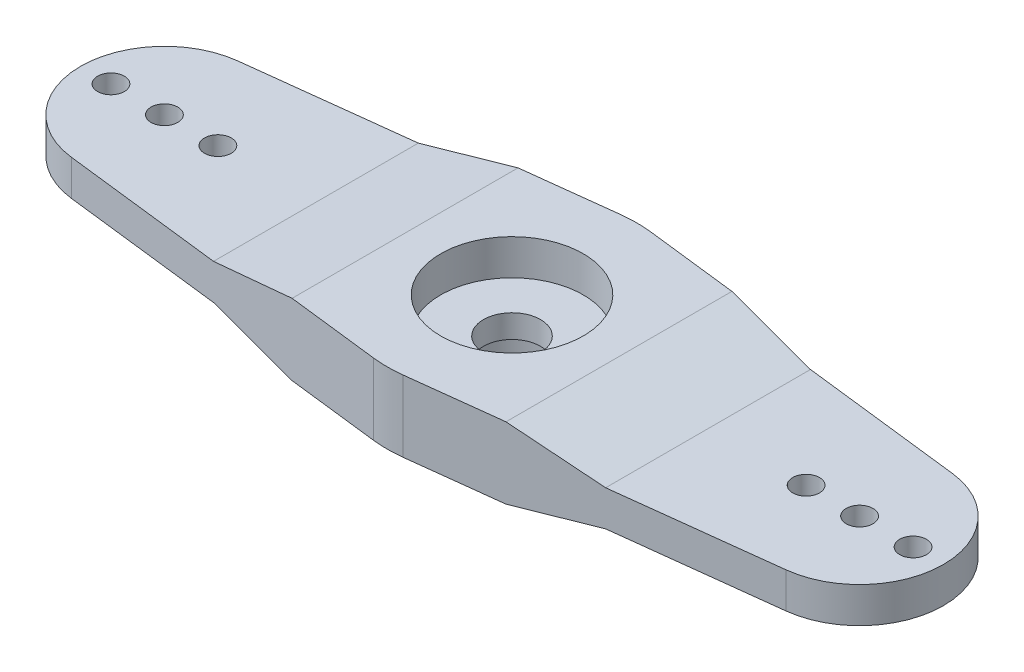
from build123d import *

# Parameters (mm, degrees)
EXTRUSION6_DEPTH        = 30
ESQUISSE8_W             = 60
ESQUISSE8_H             = 30
ENL_V_MAT_EXTRU_4_DEPTH = 43.614551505
ESQUISSE9_R             = 4
ENL_V_MAT_EXTRU_5_DEPTH = 2
ESQUISSE10_R            = 5
EXTRUSION7_DEPTH        = 0.5
ESQUISSE11_R            = 5
EXTRUSION8_DEPTH        = 1.5
EXTRUSION8_TAPER        = 45
ESQUISSE12_R            = 0.75
ENL_V_MAT_EXTRU_6_DEPTH = 38.138255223
ESQUISSE13_R            = 2.9
EXTRUSION9_DEPTH        = 2.7
ESQUISSE14_R            = 1.6
ENL_V_MAT_EXTRU_7_DEPTH = 38.016888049
ENL_V_MAT_EXTRU_8_DEPTH = 38.138255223


with BuildPart() as part:
    # Esquisse1 → Extrusion6 (new body)
    with BuildSketch(Plane.XY):
        Polygon((-30, 3), (-11, 3), (-6, 4), (6, 4), (11, 3), (30, 3), (30, 1), (11, 1), (6, 0), (-6, 0), (-11, 1), (-30, 1), align=None)
    extrude(amount=EXTRUSION6_DEPTH)

    # Esquisse8 → Enl_v. mat.-Extru.4 (cut, through all)
    with BuildSketch(Plane(origin=(0, 4, 0), x_dir=(1, 0, 0), z_dir=(0, 1, 0))):
        with Locations((0, -15)):
            Rectangle(ESQUISSE8_W, ESQUISSE8_H)
        with BuildLine():
            Line((-25.970588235, -11.027778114), (-0.823529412, -8.048611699))
            ThreePointArc((-0.823529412, -8.048611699), (0, -8), (0.823529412, -8.048611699))
            Line((0.823529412, -8.048611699), (25.970588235, -11.027778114))
            ThreePointArc((25.970588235, -11.027778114), (29.5, -15), (25.970588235, -18.972221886))
            Line((25.970588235, -18.972221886), (0.823529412, -21.951388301))
            ThreePointArc((0.823529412, -21.951388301), (0, -22), (-0.823529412, -21.951388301))
            Line((-0.823529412, -21.951388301), (-25.970588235, -18.972221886))
            ThreePointArc((-25.970588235, -18.972221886), (-29.5, -15), (-25.970588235, -11.027778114))
        make_face(mode=Mode.SUBTRACT)
    extrude(amount=-ENL_V_MAT_EXTRU_4_DEPTH, mode=Mode.SUBTRACT)

    # Esquisse9 → Enl_v. mat.-Extru.5 (cut)
    with BuildSketch(Plane(origin=(0, 4, 0), x_dir=(1, 0, 0), z_dir=(0, 1, 0))):
        with Locations(Location((0, -15, 0), (0, 0, 270))):
            Circle(ESQUISSE9_R)
    extrude(amount=-ENL_V_MAT_EXTRU_5_DEPTH, mode=Mode.SUBTRACT)

    # Esquisse10 → Extrusion7 (add)
    with BuildSketch(Plane.XZ):
        with Locations(Location((0, 15, 0), (0, 0, 90))):
            Circle(ESQUISSE10_R)
    extrude(amount=EXTRUSION7_DEPTH)

    # Esquisse11 → Extrusion8 (add)
    with BuildSketch(Plane.XZ.offset(0.5)):
        with Locations(Location((0, 15, 0), (0, 0, 90))):
            Circle(ESQUISSE11_R)
    extrude(amount=EXTRUSION8_DEPTH, taper=EXTRUSION8_TAPER)

    # Esquisse12 → Enl_v. mat.-Extru.6 (cut, through all)
    with BuildSketch(Plane(origin=(0, 3, 0), x_dir=(1, 0, 0), z_dir=(0, 1, 0))):
        with Locations(Location((-16.5, -15, 0), (0, 0, 270))):
            Circle(ESQUISSE12_R)
        with Locations(Location((-19.5, -15, 0), (0, 0, 270))):
            Circle(ESQUISSE12_R)
        with Locations(Location((-22.5, -15, 0), (0, 0, 270))):
            Circle(ESQUISSE12_R)
        with Locations(Location((-25.5, -15, 0), (0, 0, 270))):
            Circle(ESQUISSE12_R)
        with Locations(Location((16.5, -15, 0), (0, 0, 270))):
            Circle(ESQUISSE12_R)
        with Locations(Location((19.5, -15, 0), (0, 0, 270))):
            Circle(ESQUISSE12_R)
        with Locations(Location((22.5, -15, 0), (0, 0, 270))):
            Circle(ESQUISSE12_R)
        with Locations(Location((25.5, -15, 0), (0, 0, 270))):
            Circle(ESQUISSE12_R)
    extrude(amount=-ENL_V_MAT_EXTRU_6_DEPTH, mode=Mode.SUBTRACT)

    # Esquisse13 → Extrusion9 (cut)
    with BuildSketch(Plane.XZ.offset(2)):
        with Locations(Location((0, 15, 0), (0, 0, 270))):
            Circle(ESQUISSE13_R)
    extrude(amount=-EXTRUSION9_DEPTH, mode=Mode.SUBTRACT)

    # Esquisse14 → Enl_v. mat.-Extru.7 (cut, through all)
    with BuildSketch(Plane(origin=(0, 2, 0), x_dir=(1, 0, 0), z_dir=(0, 1, 0))):
        with Locations(Location((0, -15, 0), (0, 0, 270))):
            Circle(ESQUISSE14_R)
    extrude(amount=-ENL_V_MAT_EXTRU_7_DEPTH, mode=Mode.SUBTRACT)

    # Esquisse15 → Enl_v. mat.-Extru.8 (cut, through all)
    with BuildSketch(Plane(origin=(0, 3, 0), x_dir=(1, 0, 0), z_dir=(0, 1, 0))):
        with BuildLine():
            Line((25.970588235, -11.027778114), (20.053633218, -10.326797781))
            ThreePointArc((20.053633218, -10.326797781), (24.205882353, -15), (20.053633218, -19.673202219))
            Line((20.053633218, -19.673202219), (25.970588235, -18.972221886))
            ThreePointArc((25.970588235, -18.972221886), (29.5, -15), (25.970588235, -11.027778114))
        make_face()
        with BuildLine():
            Line((-25.970588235, -18.972221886), (-20.053633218, -19.673202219))
            ThreePointArc((-20.053633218, -19.673202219), (-24.205882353, -15), (-20.053633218, -10.326797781))
            Line((-20.053633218, -10.326797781), (-25.970588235, -11.027778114))
            ThreePointArc((-25.970588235, -11.027778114), (-29.5, -15), (-25.970588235, -18.972221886))
        make_face()
    extrude(amount=-ENL_V_MAT_EXTRU_8_DEPTH, mode=Mode.SUBTRACT)


solid = part.part
